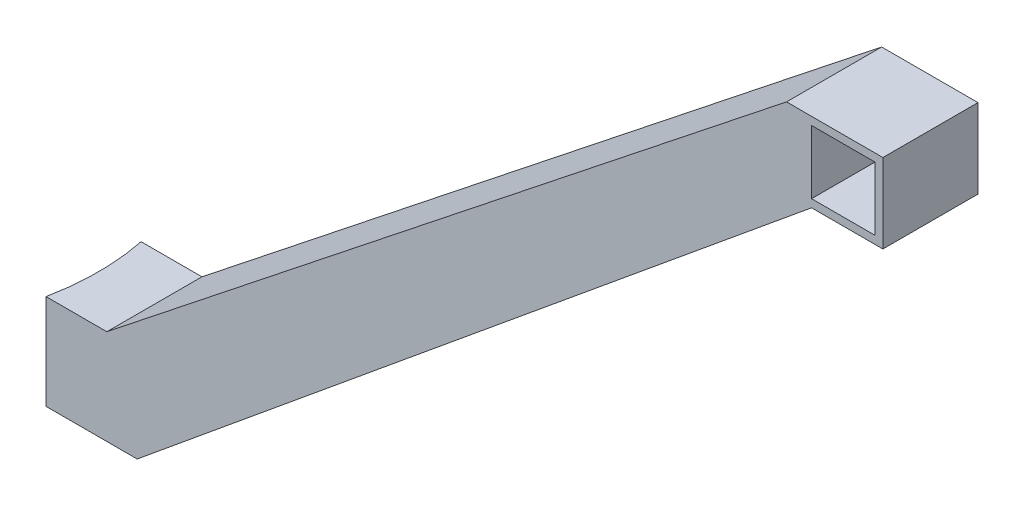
from build123d import *

# Parameters (mm, degrees)
ESQUISSE1_W             = 20
ESQUISSE1_H             = 20
BOSS_EXTRU_1_DEPTH      = 30
ESQUISSE2_R             = 75
ENL_V_MAT_EXTRU_3_DEPTH = 30
ESQUISSE3_W             = 30
ESQUISSE3_H             = 30
BOSS_EXTRU_2_DEPTH      = 10
ESQUISSE4_R             = 75
ENL_V_MAT_EXTRU_4_DEPTH = 36


with BuildPart() as part:
    # Esquisse1 → Boss.-Extru.1 (new body)
    with BuildSketch(Plane.XY):
        Polygon((12.68130267, 0), (0, 0), (0, -30), (22.248037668, -30), (235, 145), (257.5, 145), (257.5, 170), (235, 170), (227.104035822, 170), align=None)
        with Locations((245, 157.5)):
            Rectangle(ESQUISSE1_W, ESQUISSE1_H, mode=Mode.SUBTRACT)
    extrude(amount=BOSS_EXTRU_1_DEPTH)

    # Esquisse2 → Enl_v. mat.-Extru.3 (cut)
    with BuildSketch(Plane(origin=(0, 0, 0), x_dir=(1, 0, 0), z_dir=(0, 1, 0))):
        with Locations((-75, -15)):
            Circle(ESQUISSE2_R)
    extrude(amount=-ENL_V_MAT_EXTRU_3_DEPTH, mode=Mode.SUBTRACT)

    # Esquisse3 → Boss.-Extru.2 (add)
    with BuildSketch(Plane.ZY):
        with Locations((15, -15)):
            Rectangle(ESQUISSE3_W, ESQUISSE3_H)
    extrude(amount=BOSS_EXTRU_2_DEPTH)

    # Esquisse4 → Enl_v. mat.-Extru.4 (cut)
    with BuildSketch(Plane(origin=(0, 0, 0), x_dir=(1, 0, 0), z_dir=(0, 1, 0))):
        with Locations((-80, -15)):
            Circle(ESQUISSE4_R)
    extrude(amount=-ENL_V_MAT_EXTRU_4_DEPTH, mode=Mode.SUBTRACT)


solid = part.part
